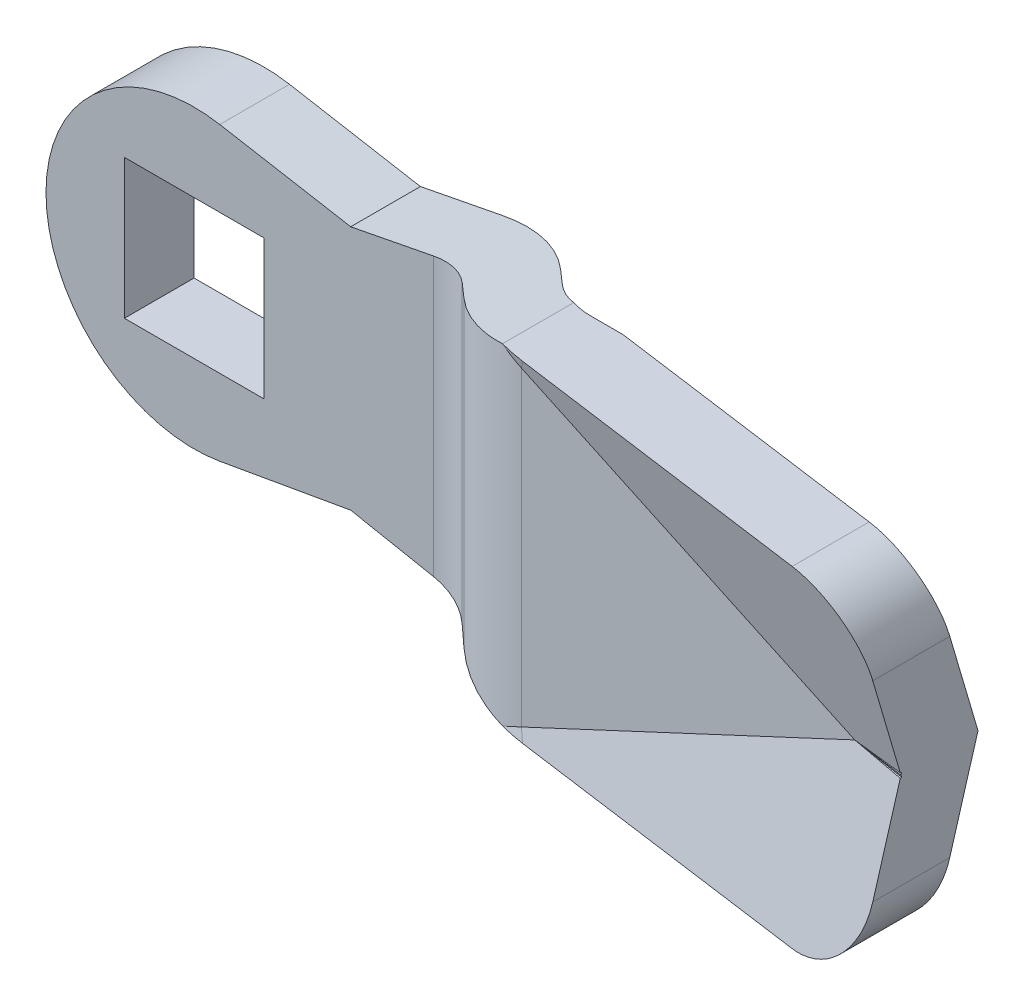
ISO-10303-21;
HEADER;
FILE_DESCRIPTION(('STEP AP214'),'2;1');
FILE_NAME('part.step','',(''),(''),'','','');
FILE_SCHEMA(('AUTOMOTIVE_DESIGN { 1 0 10303 214 1 1 1 1 }'));
ENDSEC;
DATA;
#1=APPLICATION_CONTEXT('core data for automotive mechanical design processes');
#2=APPLICATION_PROTOCOL_DEFINITION('international standard','automotive_design',2000,#1);
#3=PRODUCT_CONTEXT('',#1,'mechanical');
#4=PRODUCT('Part','Part','',(#3));
#5=PRODUCT_RELATED_PRODUCT_CATEGORY('part','',(#4));
#6=PRODUCT_DEFINITION_FORMATION('','',#4);
#7=PRODUCT_DEFINITION_CONTEXT('part definition',#1,'design');
#8=PRODUCT_DEFINITION('design','',#6,#7);
#9=PRODUCT_DEFINITION_SHAPE('','',#8);
#10=(LENGTH_UNIT() NAMED_UNIT(*) SI_UNIT(.MILLI.,.METRE.));
#11=(NAMED_UNIT(*) PLANE_ANGLE_UNIT() SI_UNIT($,.RADIAN.));
#12=(NAMED_UNIT(*) SI_UNIT($,.STERADIAN.) SOLID_ANGLE_UNIT());
#13=UNCERTAINTY_MEASURE_WITH_UNIT(LENGTH_MEASURE(1.E-05),#10,'distance_accuracy_value','');
#14=(GEOMETRIC_REPRESENTATION_CONTEXT(3) GLOBAL_UNCERTAINTY_ASSIGNED_CONTEXT((#13)) GLOBAL_UNIT_ASSIGNED_CONTEXT((#10,
#11,#12)) REPRESENTATION_CONTEXT('',''));
#15=CARTESIAN_POINT('',(0.,0.,0.));
#16=DIRECTION('',(0.,0.,1.));
#17=DIRECTION('',(1.,0.,0.));
#18=AXIS2_PLACEMENT_3D('',#15,#16,#17);
#19=CARTESIAN_POINT('',(68.0503983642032,-56.0267452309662,28.0861046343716));
#20=DIRECTION('',(0.130596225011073,-0.280064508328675,-0.951056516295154));
#21=DIRECTION('',(0.,-0.959272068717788,0.282483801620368));
#22=AXIS2_PLACEMENT_3D('',#19,#20,#21);
#23=PLANE('',#22);
#24=DIRECTION('',(-0.990703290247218,0.,-0.136040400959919));
#25=VECTOR('',#24,1.);
#26=CARTESIAN_POINT('',(69.8969690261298,-9.5,14.6386021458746));
#27=LINE('',#26,#25);
#28=CARTESIAN_POINT('',(41.,-9.5,10.6705571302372));
#29=VERTEX_POINT('',#28);
#30=CARTESIAN_POINT('',(23.0603304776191,-9.5,8.20713558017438));
#31=VERTEX_POINT('',#30);
#32=EDGE_CURVE('E494',#29,#31,#27,.T.);
#33=ORIENTED_EDGE('',*,*,#32,.F.);
#34=CARTESIAN_POINT('',(41.,-5.5,9.49264812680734));
#35=DIRECTION('',(0.130596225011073,-0.280064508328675,-0.951056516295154));
#36=DIRECTION('',(0.401933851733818,-0.861949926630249,0.309016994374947));
#37=AXIS2_PLACEMENT_3D('',#34,#35,#36);
#38=ELLIPSE('',#37,4.20584889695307,4.);
#39=CARTESIAN_POINT('',(45.,-5.5,10.0419161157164));
#40=VERTEX_POINT('',#39);
#41=EDGE_CURVE('E516',#29,#40,#38,.F.);
#42=ORIENTED_EDGE('',*,*,#41,.T.);
#43=DIRECTION('',(0.,0.959272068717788,-0.282483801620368));
#44=VECTOR('',#43,1.);
#45=CARTESIAN_POINT('',(45.,-56.884450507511,25.1734678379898));
#46=LINE('',#45,#44);
#47=CARTESIAN_POINT('',(45.,-0.136162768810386,8.46238807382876));
#48=VERTEX_POINT('',#47);
#49=EDGE_CURVE('E391',#40,#48,#46,.T.);
#50=ORIENTED_EDGE('',*,*,#49,.T.);
#51=DIRECTION('',(0.987938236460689,-0.0437421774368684,0.148541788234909));
#52=VECTOR('',#51,1.);
#53=CARTESIAN_POINT('',(72.7927650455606,-1.36672153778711,12.6411786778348));
#54=LINE('',#53,#52);
#55=CARTESIAN_POINT('',(41.9246980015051,0.,8.));
#56=VERTEX_POINT('',#55);
#57=EDGE_CURVE('E231',#56,#48,#54,.T.);
#58=ORIENTED_EDGE('',*,*,#57,.F.);
#59=DIRECTION('',(0.906307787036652,0.422618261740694,0.));
#60=VECTOR('',#59,1.);
#61=CARTESIAN_POINT('',(54.0925461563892,5.67396077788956,8.));
#62=LINE('',#61,#60);
#63=CARTESIAN_POINT('',(22.7909122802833,-8.92223081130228,8.));
#64=VERTEX_POINT('',#63);
#65=EDGE_CURVE('E451',#56,#64,#62,.F.);
#66=ORIENTED_EDGE('',*,*,#65,.T.);
#67=DIRECTION('',(-0.401933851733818,0.861949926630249,-0.309016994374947));
#68=VECTOR('',#67,1.);
#69=CARTESIAN_POINT('',(48.9166126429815,-64.9489760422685,28.0861046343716));
#70=LINE('',#69,#68);
#71=EDGE_CURVE('E438',#31,#64,#70,.T.);
#72=ORIENTED_EDGE('',*,*,#71,.F.);
#73=EDGE_LOOP('',(#33,#42,#50,#58,#66,#72));
#74=FACE_BOUND('',#73,.T.);
#75=ADVANCED_FACE('F14',(#74),#23,.F.);
#76=CARTESIAN_POINT('',(45.,32.7372831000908,-36.));
#77=DIRECTION('',(-1.,0.,0.));
#78=DIRECTION('',(0.,0.,-1.));
#79=AXIS2_PLACEMENT_3D('',#76,#77,#78);
#80=PLANE('',#79);
#81=ORIENTED_EDGE('',*,*,#49,.F.);
#82=DIRECTION('',(0.,0.,-1.));
#83=VECTOR('',#82,1.);
#84=CARTESIAN_POINT('',(45.,-5.5,-36.));
#85=LINE('',#84,#83);
#86=CARTESIAN_POINT('',(45.,-5.5,5.61962487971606));
#87=VERTEX_POINT('',#86);
#88=EDGE_CURVE('E509',#40,#87,#85,.T.);
#89=ORIENTED_EDGE('',*,*,#88,.T.);
#90=DIRECTION('',(0.,-0.959272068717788,0.282483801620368));
#91=VECTOR('',#90,1.);
#92=CARTESIAN_POINT('',(45.,-65.7408100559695,23.3591730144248));
#93=LINE('',#92,#91);
#94=CARTESIAN_POINT('',(45.,0.,4.));
#95=VERTEX_POINT('',#94);
#96=EDGE_CURVE('E395',#95,#87,#93,.T.);
#97=ORIENTED_EDGE('',*,*,#96,.F.);
#98=DIRECTION('',(0.,-0.959272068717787,-0.28248380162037));
#99=VECTOR('',#98,1.);
#100=CARTESIAN_POINT('',(45.,35.0762353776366,14.3291533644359));
#101=LINE('',#100,#99);
#102=CARTESIAN_POINT('',(45.,5.5,5.61962487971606));
#103=VERTEX_POINT('',#102);
#104=EDGE_CURVE('E393',#103,#95,#101,.T.);
#105=ORIENTED_EDGE('',*,*,#104,.F.);
#106=DIRECTION('',(0.,0.,-1.));
#107=VECTOR('',#106,1.);
#108=CARTESIAN_POINT('',(45.,5.5,-36.));
#109=LINE('',#108,#107);
#110=CARTESIAN_POINT('',(45.,5.5,10.0419161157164));
#111=VERTEX_POINT('',#110);
#112=EDGE_CURVE('E507',#103,#111,#109,.F.);
#113=ORIENTED_EDGE('',*,*,#112,.T.);
#114=DIRECTION('',(0.,0.959272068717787,0.28248380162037));
#115=VECTOR('',#114,1.);
#116=CARTESIAN_POINT('',(45.,43.172066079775,21.1354825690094));
#117=LINE('',#116,#115);
#118=CARTESIAN_POINT('',(45.,0.136162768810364,8.46238807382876));
#119=VERTEX_POINT('',#118);
#120=EDGE_CURVE('E389',#119,#111,#117,.T.);
#121=ORIENTED_EDGE('',*,*,#120,.F.);
#122=DIRECTION('',(0.,-0.282483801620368,-0.959272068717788));
#123=VECTOR('',#122,1.);
#124=CARTESIAN_POINT('',(45.,-9.31072791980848,-23.6178173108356));
#125=LINE('',#124,#123);
#126=CARTESIAN_POINT('',(45.,0.114431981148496,8.38859362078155));
#127=VERTEX_POINT('',#126);
#128=EDGE_CURVE('E503',#119,#127,#125,.T.);
#129=ORIENTED_EDGE('',*,*,#128,.T.);
#130=CARTESIAN_POINT('',(45.,0.,8.42229123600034));
#131=VERTEX_POINT('',#130);
#132=EDGE_CURVE('E246',#131,#127,#46,.T.);
#133=ORIENTED_EDGE('',*,*,#132,.F.);
#134=DIRECTION('',(0.,-0.959272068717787,-0.282483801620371));
#135=VECTOR('',#134,1.);
#136=CARTESIAN_POINT('',(45.,18.0874428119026,13.7486316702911));
#137=LINE('',#136,#135);
#138=CARTESIAN_POINT('',(45.,-0.114431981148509,8.38859362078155));
#139=VERTEX_POINT('',#138);
#140=EDGE_CURVE('E239',#131,#139,#137,.T.);
#141=ORIENTED_EDGE('',*,*,#140,.T.);
#142=DIRECTION('',(0.,0.28248380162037,-0.959272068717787));
#143=VECTOR('',#142,1.);
#144=CARTESIAN_POINT('',(45.,14.5354083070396,-41.3600380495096));
#145=LINE('',#144,#143);
#146=EDGE_CURVE('E225',#48,#139,#145,.T.);
#147=ORIENTED_EDGE('',*,*,#146,.F.);
#148=EDGE_LOOP('',(#81,#89,#97,#105,#113,#121,#129,#133,#141,#147));
#149=FACE_BOUND('',#148,.T.);
#150=ADVANCED_FACE('F244',(#149),#80,.F.);
#151=CARTESIAN_POINT('',(10.5,-2.8,-2.4));
#152=DIRECTION('',(1.,0.,0.));
#153=DIRECTION('',(0.,0.,1.));
#154=AXIS2_PLACEMENT_3D('',#151,#152,#153);
#155=PLANE('',#154);
#156=DIRECTION('',(0.,0.,1.));
#157=VECTOR('',#156,1.);
#158=CARTESIAN_POINT('',(10.5,-2.8,-2.4));
#159=LINE('',#158,#157);
#160=CARTESIAN_POINT('',(10.5,-2.8,-0.4));
#161=VERTEX_POINT('',#160);
#162=CARTESIAN_POINT('',(10.5,-2.8,0.));
#163=VERTEX_POINT('',#162);
#164=EDGE_CURVE('E291',#161,#163,#159,.T.);
#165=ORIENTED_EDGE('',*,*,#164,.F.);
#166=DIRECTION('',(0.,-1.,0.));
#167=VECTOR('',#166,1.);
#168=CARTESIAN_POINT('',(10.5,9.5,-0.4));
#169=LINE('',#168,#167);
#170=CARTESIAN_POINT('',(10.5,2.8,-0.4));
#171=VERTEX_POINT('',#170);
#172=EDGE_CURVE('E257',#171,#161,#169,.T.);
#173=ORIENTED_EDGE('',*,*,#172,.F.);
#174=DIRECTION('',(0.,0.,1.));
#175=VECTOR('',#174,1.);
#176=CARTESIAN_POINT('',(10.5,2.8,-2.4));
#177=LINE('',#176,#175);
#178=CARTESIAN_POINT('',(10.5,2.8,0.));
#179=VERTEX_POINT('',#178);
#180=EDGE_CURVE('E283',#171,#179,#177,.T.);
#181=ORIENTED_EDGE('',*,*,#180,.T.);
#182=DIRECTION('',(0.,1.,0.));
#183=VECTOR('',#182,1.);
#184=CARTESIAN_POINT('',(10.5,-2.8,0.));
#185=LINE('',#184,#183);
#186=EDGE_CURVE('E264',#163,#179,#185,.T.);
#187=ORIENTED_EDGE('',*,*,#186,.F.);
#188=EDGE_LOOP('',(#165,#173,#181,#187));
#189=FACE_BOUND('',#188,.T.);
#190=ADVANCED_FACE('F620',(#189),#155,.T.);
#191=CARTESIAN_POINT('',(10.5,-2.8,-2.4));
#192=DIRECTION('',(0.,1.,0.));
#193=DIRECTION('',(1.,0.,0.));
#194=AXIS2_PLACEMENT_3D('',#191,#192,#193);
#195=PLANE('',#194);
#196=DIRECTION('',(0.707106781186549,0.,0.707106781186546));
#197=VECTOR('',#196,1.);
#198=CARTESIAN_POINT('',(8.5,-2.8,-2.4));
#199=LINE('',#198,#197);
#200=CARTESIAN_POINT('',(8.5,-2.8,-2.4));
#201=VERTEX_POINT('',#200);
#202=EDGE_CURVE('E254',#201,#161,#199,.T.);
#203=ORIENTED_EDGE('',*,*,#202,.T.);
#204=ORIENTED_EDGE('',*,*,#164,.T.);
#205=DIRECTION('',(-1.,0.,0.));
#206=VECTOR('',#205,1.);
#207=CARTESIAN_POINT('',(10.5,-2.8,0.));
#208=LINE('',#207,#206);
#209=CARTESIAN_POINT('',(6.5,-2.8,0.));
#210=VERTEX_POINT('',#209);
#211=EDGE_CURVE('E272',#163,#210,#208,.T.);
#212=ORIENTED_EDGE('',*,*,#211,.T.);
#213=DIRECTION('',(0.,0.,1.));
#214=VECTOR('',#213,1.);
#215=CARTESIAN_POINT('',(6.5,-2.8,-2.4));
#216=LINE('',#215,#214);
#217=CARTESIAN_POINT('',(6.5,-2.8,-2.4));
#218=VERTEX_POINT('',#217);
#219=EDGE_CURVE('E288',#218,#210,#216,.T.);
#220=ORIENTED_EDGE('',*,*,#219,.F.);
#221=DIRECTION('',(-1.,0.,0.));
#222=VECTOR('',#221,1.);
#223=CARTESIAN_POINT('',(10.5,-2.8,-2.4));
#224=LINE('',#223,#222);
#225=EDGE_CURVE('E281',#201,#218,#224,.T.);
#226=ORIENTED_EDGE('',*,*,#225,.F.);
#227=EDGE_LOOP('',(#203,#204,#212,#220,#226));
#228=FACE_BOUND('',#227,.T.);
#229=ADVANCED_FACE('F653',(#228),#195,.F.);
#230=CARTESIAN_POINT('',(6.5,2.8,-2.4));
#231=DIRECTION('',(0.,-1.,0.));
#232=DIRECTION('',(-1.,0.,0.));
#233=AXIS2_PLACEMENT_3D('',#230,#231,#232);
#234=PLANE('',#233);
#235=DIRECTION('',(0.707106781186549,0.,0.707106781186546));
#236=VECTOR('',#235,1.);
#237=CARTESIAN_POINT('',(7.5,2.8,-3.4));
#238=LINE('',#237,#236);
#239=CARTESIAN_POINT('',(8.5,2.8,-2.4));
#240=VERTEX_POINT('',#239);
#241=EDGE_CURVE('E262',#240,#171,#238,.T.);
#242=ORIENTED_EDGE('',*,*,#241,.F.);
#243=DIRECTION('',(1.,0.,0.));
#244=VECTOR('',#243,1.);
#245=CARTESIAN_POINT('',(6.5,2.8,-2.4));
#246=LINE('',#245,#244);
#247=CARTESIAN_POINT('',(6.5,2.8,-2.4));
#248=VERTEX_POINT('',#247);
#249=EDGE_CURVE('E275',#248,#240,#246,.T.);
#250=ORIENTED_EDGE('',*,*,#249,.F.);
#251=DIRECTION('',(0.,0.,1.));
#252=VECTOR('',#251,1.);
#253=CARTESIAN_POINT('',(6.5,2.8,-2.4));
#254=LINE('',#253,#252);
#255=CARTESIAN_POINT('',(6.5,2.8,0.));
#256=VERTEX_POINT('',#255);
#257=EDGE_CURVE('E285',#248,#256,#254,.T.);
#258=ORIENTED_EDGE('',*,*,#257,.T.);
#259=DIRECTION('',(1.,0.,0.));
#260=VECTOR('',#259,1.);
#261=CARTESIAN_POINT('',(6.5,2.8,0.));
#262=LINE('',#261,#260);
#263=EDGE_CURVE('E267',#256,#179,#262,.T.);
#264=ORIENTED_EDGE('',*,*,#263,.T.);
#265=ORIENTED_EDGE('',*,*,#180,.F.);
#266=EDGE_LOOP('',(#242,#250,#258,#264,#265));
#267=FACE_BOUND('',#266,.T.);
#268=ADVANCED_FACE('F649',(#267),#234,.F.);
#269=CARTESIAN_POINT('',(10.5,2.8,-2.4));
#270=DIRECTION('',(0.,0.,-1.));
#271=DIRECTION('',(0.,-1.,0.));
#272=AXIS2_PLACEMENT_3D('',#269,#270,#271);
#273=PLANE('',#272);
#274=ORIENTED_EDGE('',*,*,#249,.T.);
#275=DIRECTION('',(0.,-1.,0.));
#276=VECTOR('',#275,1.);
#277=CARTESIAN_POINT('',(8.5,9.5,-2.4));
#278=LINE('',#277,#276);
#279=EDGE_CURVE('E259',#240,#201,#278,.T.);
#280=ORIENTED_EDGE('',*,*,#279,.T.);
#281=ORIENTED_EDGE('',*,*,#225,.T.);
#282=DIRECTION('',(0.,-1.,0.));
#283=VECTOR('',#282,1.);
#284=CARTESIAN_POINT('',(6.5,2.8,-2.4));
#285=LINE('',#284,#283);
#286=EDGE_CURVE('E278',#248,#218,#285,.T.);
#287=ORIENTED_EDGE('',*,*,#286,.F.);
#288=EDGE_LOOP('',(#274,#280,#281,#287));
#289=FACE_BOUND('',#288,.T.);
#290=ADVANCED_FACE('F646',(#289),#273,.T.);
#291=CARTESIAN_POINT('',(13.7420938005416,-9.5,0.));
#292=DIRECTION('',(0.,0.,-1.));
#293=DIRECTION('',(1.,0.,0.));
#294=AXIS2_PLACEMENT_3D('',#291,#292,#293);
#295=PLANE('',#294);
#296=DIRECTION('',(0.984807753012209,-0.173648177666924,0.));
#297=VECTOR('',#296,1.);
#298=CARTESIAN_POINT('',(16.4283241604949,5.73436940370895,0.));
#299=LINE('',#298,#297);
#300=CARTESIAN_POINT('',(1.47600951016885,8.37086590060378,0.));
#301=VERTEX_POINT('',#300);
#302=CARTESIAN_POINT('',(8.9917311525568,7.0456413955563,0.));
#303=VERTEX_POINT('',#302);
#304=EDGE_CURVE('E500',#301,#303,#299,.T.);
#305=ORIENTED_EDGE('',*,*,#304,.T.);
#306=DIRECTION('',(0.981627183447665,0.190808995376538,0.));
#307=VECTOR('',#306,1.);
#308=CARTESIAN_POINT('',(10.4700890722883,7.33300506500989,0.));
#309=LINE('',#308,#307);
#310=CARTESIAN_POINT('',(13.7420938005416,7.96901835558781,0.));
#311=VERTEX_POINT('',#310);
#312=EDGE_CURVE('E319',#303,#311,#309,.T.);
#313=ORIENTED_EDGE('',*,*,#312,.T.);
#314=DIRECTION('',(0.,1.,0.));
#315=VECTOR('',#314,1.);
#316=CARTESIAN_POINT('',(13.7420938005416,-9.5,0.));
#317=LINE('',#316,#315);
#318=CARTESIAN_POINT('',(13.7420938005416,-7.96901835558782,0.));
#319=VERTEX_POINT('',#318);
#320=EDGE_CURVE('E479',#319,#311,#317,.T.);
#321=ORIENTED_EDGE('',*,*,#320,.F.);
#322=DIRECTION('',(0.981627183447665,-0.190808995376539,0.));
#323=VECTOR('',#322,1.);
#324=CARTESIAN_POINT('',(14.0288517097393,-8.02475844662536,0.));
#325=LINE('',#324,#323);
#326=CARTESIAN_POINT('',(8.9917311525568,-7.0456413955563,0.));
#327=VERTEX_POINT('',#326);
#328=EDGE_CURVE('E334',#327,#319,#325,.T.);
#329=ORIENTED_EDGE('',*,*,#328,.F.);
#330=DIRECTION('',(0.984807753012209,0.173648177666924,0.));
#331=VECTOR('',#330,1.);
#332=CARTESIAN_POINT('',(13.1791327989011,-6.30728950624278,0.));
#333=LINE('',#332,#331);
#334=CARTESIAN_POINT('',(1.47600951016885,-8.37086590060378,0.));
#335=VERTEX_POINT('',#334);
#336=EDGE_CURVE('E498',#335,#327,#333,.T.);
#337=ORIENTED_EDGE('',*,*,#336,.F.);
#338=CARTESIAN_POINT('',(0.,0.,0.));
#339=DIRECTION('',(0.,0.,-1.));
#340=DIRECTION('',(1.,0.,0.));
#341=AXIS2_PLACEMENT_3D('',#338,#339,#340);
#342=CIRCLE('',#341,8.5);
#343=EDGE_CURVE('E348',#335,#301,#342,.T.);
#344=ORIENTED_EDGE('',*,*,#343,.T.);
#345=EDGE_LOOP('',(#305,#313,#321,#329,#337,#344));
#346=FACE_BOUND('',#345,.T.);
#347=DIRECTION('',(1.,0.,0.));
#348=VECTOR('',#347,1.);
#349=CARTESIAN_POINT('',(-4.,-4.,0.));
#350=LINE('',#349,#348);
#351=CARTESIAN_POINT('',(-4.,-4.,0.));
#352=VERTEX_POINT('',#351);
#353=CARTESIAN_POINT('',(4.,-4.,0.));
#354=VERTEX_POINT('',#353);
#355=EDGE_CURVE('E372',#352,#354,#350,.T.);
#356=ORIENTED_EDGE('',*,*,#355,.T.);
#357=DIRECTION('',(0.,-1.,0.));
#358=VECTOR('',#357,1.);
#359=CARTESIAN_POINT('',(4.,4.,0.));
#360=LINE('',#359,#358);
#361=CARTESIAN_POINT('',(4.,4.,0.));
#362=VERTEX_POINT('',#361);
#363=EDGE_CURVE('E369',#362,#354,#360,.T.);
#364=ORIENTED_EDGE('',*,*,#363,.F.);
#365=DIRECTION('',(-1.,0.,0.));
#366=VECTOR('',#365,1.);
#367=CARTESIAN_POINT('',(4.,4.,0.));
#368=LINE('',#367,#366);
#369=CARTESIAN_POINT('',(-4.,4.,0.));
#370=VERTEX_POINT('',#369);
#371=EDGE_CURVE('E377',#362,#370,#368,.T.);
#372=ORIENTED_EDGE('',*,*,#371,.T.);
#373=DIRECTION('',(0.,1.,0.));
#374=VECTOR('',#373,1.);
#375=CARTESIAN_POINT('',(-4.,-4.,0.));
#376=LINE('',#375,#374);
#377=EDGE_CURVE('E375',#352,#370,#376,.T.);
#378=ORIENTED_EDGE('',*,*,#377,.F.);
#379=EDGE_LOOP('',(#356,#364,#372,#378));
#380=FACE_BOUND('',#379,.T.);
#381=ORIENTED_EDGE('',*,*,#211,.F.);
#382=ORIENTED_EDGE('',*,*,#186,.T.);
#383=ORIENTED_EDGE('',*,*,#263,.F.);
#384=DIRECTION('',(0.,-1.,0.));
#385=VECTOR('',#384,1.);
#386=CARTESIAN_POINT('',(6.5,2.8,0.));
#387=LINE('',#386,#385);
#388=EDGE_CURVE('E270',#256,#210,#387,.T.);
#389=ORIENTED_EDGE('',*,*,#388,.T.);
#390=EDGE_LOOP('',(#381,#382,#383,#389));
#391=FACE_BOUND('',#390,.T.);
#392=ADVANCED_FACE('F593',(#346,#380,#391),#295,.T.);
#393=CARTESIAN_POINT('',(13.7420938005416,-9.5,4.));
#394=DIRECTION('',(0.,0.,-1.));
#395=DIRECTION('',(1.,0.,0.));
#396=AXIS2_PLACEMENT_3D('',#393,#394,#395);
#397=PLANE('',#396);
#398=DIRECTION('',(0.,-1.,0.));
#399=VECTOR('',#398,1.);
#400=CARTESIAN_POINT('',(4.,4.,4.));
#401=LINE('',#400,#399);
#402=CARTESIAN_POINT('',(4.,4.,4.));
#403=VERTEX_POINT('',#402);
#404=CARTESIAN_POINT('',(4.,-4.,4.));
#405=VERTEX_POINT('',#404);
#406=EDGE_CURVE('E357',#403,#405,#401,.T.);
#407=ORIENTED_EDGE('',*,*,#406,.T.);
#408=DIRECTION('',(1.,0.,0.));
#409=VECTOR('',#408,1.);
#410=CARTESIAN_POINT('',(-4.,-4.,4.));
#411=LINE('',#410,#409);
#412=CARTESIAN_POINT('',(-4.,-4.,4.));
#413=VERTEX_POINT('',#412);
#414=EDGE_CURVE('E360',#413,#405,#411,.T.);
#415=ORIENTED_EDGE('',*,*,#414,.F.);
#416=DIRECTION('',(0.,1.,0.));
#417=VECTOR('',#416,1.);
#418=CARTESIAN_POINT('',(-4.,-4.,4.));
#419=LINE('',#418,#417);
#420=CARTESIAN_POINT('',(-4.,4.,4.));
#421=VERTEX_POINT('',#420);
#422=EDGE_CURVE('E363',#413,#421,#419,.T.);
#423=ORIENTED_EDGE('',*,*,#422,.T.);
#424=DIRECTION('',(-1.,0.,0.));
#425=VECTOR('',#424,1.);
#426=CARTESIAN_POINT('',(4.,4.,4.));
#427=LINE('',#426,#425);
#428=EDGE_CURVE('E366',#403,#421,#427,.T.);
#429=ORIENTED_EDGE('',*,*,#428,.F.);
#430=EDGE_LOOP('',(#407,#415,#423,#429));
#431=FACE_BOUND('',#430,.T.);
#432=DIRECTION('',(0.981627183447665,0.190808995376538,0.));
#433=VECTOR('',#432,1.);
#434=CARTESIAN_POINT('',(10.4700890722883,7.33300506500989,4.));
#435=LINE('',#434,#433);
#436=CARTESIAN_POINT('',(8.9917311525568,7.0456413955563,4.));
#437=VERTEX_POINT('',#436);
#438=CARTESIAN_POINT('',(13.7420938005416,7.96901835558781,4.));
#439=VERTEX_POINT('',#438);
#440=EDGE_CURVE('E328',#437,#439,#435,.T.);
#441=ORIENTED_EDGE('',*,*,#440,.F.);
#442=DIRECTION('',(0.984807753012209,-0.173648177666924,0.));
#443=VECTOR('',#442,1.);
#444=CARTESIAN_POINT('',(16.4283241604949,5.73436940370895,4.));
#445=LINE('',#444,#443);
#446=CARTESIAN_POINT('',(1.47600951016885,8.37086590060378,4.));
#447=VERTEX_POINT('',#446);
#448=EDGE_CURVE('E355',#447,#437,#445,.T.);
#449=ORIENTED_EDGE('',*,*,#448,.F.);
#450=CARTESIAN_POINT('',(0.,0.,4.));
#451=DIRECTION('',(0.,0.,-1.));
#452=DIRECTION('',(1.,0.,0.));
#453=AXIS2_PLACEMENT_3D('',#450,#451,#452);
#454=CIRCLE('',#453,8.5);
#455=CARTESIAN_POINT('',(1.47600951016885,-8.37086590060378,4.));
#456=VERTEX_POINT('',#455);
#457=EDGE_CURVE('E350',#456,#447,#454,.T.);
#458=ORIENTED_EDGE('',*,*,#457,.F.);
#459=DIRECTION('',(0.984807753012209,0.173648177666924,0.));
#460=VECTOR('',#459,1.);
#461=CARTESIAN_POINT('',(13.1791327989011,-6.30728950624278,4.));
#462=LINE('',#461,#460);
#463=CARTESIAN_POINT('',(8.9917311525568,-7.0456413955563,4.));
#464=VERTEX_POINT('',#463);
#465=EDGE_CURVE('E352',#456,#464,#462,.T.);
#466=ORIENTED_EDGE('',*,*,#465,.T.);
#467=DIRECTION('',(0.981627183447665,-0.190808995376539,0.));
#468=VECTOR('',#467,1.);
#469=CARTESIAN_POINT('',(14.0288517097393,-8.02475844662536,4.));
#470=LINE('',#469,#468);
#471=CARTESIAN_POINT('',(13.7420938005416,-7.96901835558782,4.));
#472=VERTEX_POINT('',#471);
#473=EDGE_CURVE('E345',#464,#472,#470,.T.);
#474=ORIENTED_EDGE('',*,*,#473,.T.);
#475=DIRECTION('',(0.,1.,0.));
#476=VECTOR('',#475,1.);
#477=CARTESIAN_POINT('',(13.7420938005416,-9.5,4.));
#478=LINE('',#477,#476);
#479=EDGE_CURVE('E482',#472,#439,#478,.T.);
#480=ORIENTED_EDGE('',*,*,#479,.T.);
#481=EDGE_LOOP('',(#441,#449,#458,#466,#474,#480));
#482=FACE_BOUND('',#481,.T.);
#483=ADVANCED_FACE('F584',(#431,#482),#397,.F.);
#484=CARTESIAN_POINT('',(22.7909122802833,-9.5,0.));
#485=DIRECTION('',(0.,1.,0.));
#486=DIRECTION('',(1.,0.,0.));
#487=AXIS2_PLACEMENT_3D('',#484,#485,#486);
#488=CYLINDRICAL_SURFACE('',#487,8.);
#489=CARTESIAN_POINT('',(22.7909122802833,9.72793048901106,0.));
#490=DIRECTION('',(-0.190808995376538,0.981627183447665,0.));
#491=DIRECTION('',(0.981627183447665,0.190808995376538,0.));
#492=AXIS2_PLACEMENT_3D('',#489,#490,#491);
#493=ELLIPSE('',#492,8.1497335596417,8.);
#494=CARTESIAN_POINT('',(17.4378674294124,8.68740397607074,5.94515860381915));
#495=VERTEX_POINT('',#494);
#496=CARTESIAN_POINT('',(21.6183115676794,9.5,7.9135963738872));
#497=VERTEX_POINT('',#496);
#498=EDGE_CURVE('E326',#495,#497,#493,.T.);
#499=ORIENTED_EDGE('',*,*,#498,.F.);
#500=DIRECTION('',(0.,1.,0.));
#501=VECTOR('',#500,1.);
#502=CARTESIAN_POINT('',(17.4378674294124,-9.5,5.94515860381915));
#503=LINE('',#502,#501);
#504=CARTESIAN_POINT('',(17.4378674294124,-8.68740397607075,5.94515860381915));
#505=VERTEX_POINT('',#504);
#506=EDGE_CURVE('E488',#505,#495,#503,.T.);
#507=ORIENTED_EDGE('',*,*,#506,.F.);
#508=CARTESIAN_POINT('',(22.7909122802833,-9.72793048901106,0.));
#509=DIRECTION('',(0.190808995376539,0.981627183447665,0.));
#510=DIRECTION('',(-0.981627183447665,0.190808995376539,0.));
#511=AXIS2_PLACEMENT_3D('',#508,#509,#510);
#512=ELLIPSE('',#511,8.1497335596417,8.);
#513=CARTESIAN_POINT('',(21.6183115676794,-9.5,7.91359637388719));
#514=VERTEX_POINT('',#513);
#515=EDGE_CURVE('E342',#505,#514,#512,.T.);
#516=ORIENTED_EDGE('',*,*,#515,.T.);
#517=CARTESIAN_POINT('',(22.7909122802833,-11.7903045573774,0.));
#518=DIRECTION('',(-0.401933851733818,0.861949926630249,-0.309016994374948));
#519=DIRECTION('',(0.683336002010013,0.506993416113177,0.52536614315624));
#520=AXIS2_PLACEMENT_3D('',#517,#518,#519);
#521=ELLIPSE('',#520,9.28128160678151,8.);
#522=EDGE_CURVE('E457',#64,#514,#521,.F.);
#523=ORIENTED_EDGE('',*,*,#522,.F.);
#524=DIRECTION('',(0.,1.,0.));
#525=VECTOR('',#524,1.);
#526=CARTESIAN_POINT('',(22.7909122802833,-9.5,8.));
#527=LINE('',#526,#525);
#528=CARTESIAN_POINT('',(22.7909122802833,8.9222308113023,8.));
#529=VERTEX_POINT('',#528);
#530=EDGE_CURVE('E491',#64,#529,#527,.T.);
#531=ORIENTED_EDGE('',*,*,#530,.T.);
#532=CARTESIAN_POINT('',(22.7909122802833,11.7903045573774,0.));
#533=DIRECTION('',(-0.401933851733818,-0.861949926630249,-0.309016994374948));
#534=DIRECTION('',(-0.683336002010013,0.506993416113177,-0.52536614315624));
#535=AXIS2_PLACEMENT_3D('',#532,#533,#534);
#536=ELLIPSE('',#535,9.28128160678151,8.);
#537=EDGE_CURVE('E454',#529,#497,#536,.T.);
#538=ORIENTED_EDGE('',*,*,#537,.T.);
#539=EDGE_LOOP('',(#499,#507,#516,#523,#531,#538));
#540=FACE_BOUND('',#539,.T.);
#541=ADVANCED_FACE('F541',(#540),#488,.T.);
#542=CARTESIAN_POINT('',(22.7909122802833,-9.5,0.));
#543=DIRECTION('',(0.,-1.,0.));
#544=DIRECTION('',(-1.,0.,0.));
#545=AXIS2_PLACEMENT_3D('',#542,#543,#544);
#546=PLANE('',#545);
#547=DIRECTION('',(0.990703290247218,0.,0.136040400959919));
#548=VECTOR('',#547,1.);
#549=CARTESIAN_POINT('',(52.9764947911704,-9.5,7.89284219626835));
#550=LINE('',#549,#548);
#551=CARTESIAN_POINT('',(24.6271842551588,-9.5,4.));
#552=VERTEX_POINT('',#551);
#553=CARTESIAN_POINT('',(41.,-9.5,6.24826589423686));
#554=VERTEX_POINT('',#553);
#555=EDGE_CURVE('E398',#552,#554,#550,.T.);
#556=ORIENTED_EDGE('',*,*,#555,.T.);
#557=DIRECTION('',(0.,0.,-1.));
#558=VECTOR('',#557,1.);
#559=CARTESIAN_POINT('',(41.,-9.5,-36.));
#560=LINE('',#559,#558);
#561=EDGE_CURVE('E514',#554,#29,#560,.F.);
#562=ORIENTED_EDGE('',*,*,#561,.T.);
#563=ORIENTED_EDGE('',*,*,#32,.T.);
#564=CARTESIAN_POINT('',(21.6183115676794,-9.5,7.9135963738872));
#565=CARTESIAN_POINT('',(21.6973659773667,-9.50000000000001,7.93487714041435));
#566=CARTESIAN_POINT('',(21.776634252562,-9.50000000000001,7.95536573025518));
#567=CARTESIAN_POINT('',(21.9355021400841,-9.50000000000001,7.99470672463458));
#568=CARTESIAN_POINT('',(22.0151014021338,-9.50000000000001,8.01356054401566));
#569=CARTESIAN_POINT('',(22.1746370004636,-9.50000000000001,8.04960931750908));
#570=CARTESIAN_POINT('',(22.2545731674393,-9.50000000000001,8.06680502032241));
#571=CARTESIAN_POINT('',(22.4147913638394,-9.50000000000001,8.09951145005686));
#572=CARTESIAN_POINT('',(22.4950734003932,-9.50000000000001,8.11502214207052));
#573=CARTESIAN_POINT('',(22.6559863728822,-9.50000000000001,8.14432725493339));
#574=CARTESIAN_POINT('',(22.7366174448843,-9.50000000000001,8.15812092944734));
#575=CARTESIAN_POINT('',(22.8982340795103,-9.50000000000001,8.18395686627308));
#576=CARTESIAN_POINT('',(22.9792198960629,-9.50000000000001,8.19599753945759));
#577=CARTESIAN_POINT('',(23.0603304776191,-9.5,8.20713558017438));
#578=B_SPLINE_CURVE_WITH_KNOTS('',3,(#564,#565,#566,#567,#568,#569,#570,#571,#572,#573,#574,
#575,#576,#577),.UNSPECIFIED.,.F.,.F.,(4,2,2,2,2,2,4),(0.,0.245602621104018,0.490990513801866,
0.736267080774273,0.981548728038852,1.2269366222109,1.47254559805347),.UNSPECIFIED.);
#579=EDGE_CURVE('E401',#514,#31,#578,.T.);
#580=ORIENTED_EDGE('',*,*,#579,.F.);
#581=DIRECTION('',(0.,0.,1.));
#582=VECTOR('',#581,1.);
#583=CARTESIAN_POINT('',(21.6183115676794,-9.5,-21.));
#584=LINE('',#583,#582);
#585=CARTESIAN_POINT('',(21.6183115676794,-9.5,3.82426562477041));
#586=VERTEX_POINT('',#585);
#587=EDGE_CURVE('E293',#586,#514,#584,.T.);
#588=ORIENTED_EDGE('',*,*,#587,.F.);
#589=CARTESIAN_POINT('',(22.7909122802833,-9.5,0.));
#590=DIRECTION('',(0.,-1.,0.));
#591=DIRECTION('',(-1.,0.,0.));
#592=AXIS2_PLACEMENT_3D('',#589,#590,#591);
#593=CIRCLE('',#592,4.);
#594=CARTESIAN_POINT('',(22.7909122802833,-9.5,4.));
#595=VERTEX_POINT('',#594);
#596=EDGE_CURVE('E465',#595,#586,#593,.T.);
#597=ORIENTED_EDGE('',*,*,#596,.F.);
#598=DIRECTION('',(-1.,0.,0.));
#599=VECTOR('',#598,1.);
#600=CARTESIAN_POINT('',(45.,-9.5,4.));
#601=LINE('',#600,#599);
#602=EDGE_CURVE('E468',#552,#595,#601,.T.);
#603=ORIENTED_EDGE('',*,*,#602,.F.);
#604=EDGE_LOOP('',(#556,#562,#563,#580,#588,#597,#603));
#605=FACE_BOUND('',#604,.T.);
#606=ADVANCED_FACE('F558',(#605),#546,.T.);
#607=CARTESIAN_POINT('',(17.4378674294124,-9.5,5.94515860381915));
#608=DIRECTION('',(0.66913060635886,0.,-0.743144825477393));
#609=DIRECTION('',(0.743144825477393,0.,0.66913060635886));
#610=AXIS2_PLACEMENT_3D('',#607,#608,#609);
#611=PLANE('',#610);
#612=DIRECTION('',(0.735510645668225,0.142968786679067,0.662256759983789));
#613=VECTOR('',#612,1.);
#614=CARTESIAN_POINT('',(15.5253697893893,8.31565209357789,4.22313799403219));
#615=LINE('',#614,#613);
#616=CARTESIAN_POINT('',(16.418616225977,8.48928161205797,5.02742069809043));
#617=VERTEX_POINT('',#616);
#618=EDGE_CURVE('E324',#617,#495,#615,.T.);
#619=ORIENTED_EDGE('',*,*,#618,.F.);
#620=DIRECTION('',(0.,1.,0.));
#621=VECTOR('',#620,1.);
#622=CARTESIAN_POINT('',(16.418616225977,-9.5,5.02742069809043));
#623=LINE('',#622,#621);
#624=CARTESIAN_POINT('',(16.418616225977,-8.48928161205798,5.02742069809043));
#625=VERTEX_POINT('',#624);
#626=EDGE_CURVE('E485',#625,#617,#623,.T.);
#627=ORIENTED_EDGE('',*,*,#626,.F.);
#628=DIRECTION('',(0.735510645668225,-0.142968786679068,0.662256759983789));
#629=VECTOR('',#628,1.);
#630=CARTESIAN_POINT('',(17.5233160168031,-8.70401349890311,6.02209685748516));
#631=LINE('',#630,#629);
#632=EDGE_CURVE('E339',#625,#505,#631,.T.);
#633=ORIENTED_EDGE('',*,*,#632,.T.);
#634=ORIENTED_EDGE('',*,*,#506,.T.);
#635=EDGE_LOOP('',(#619,#627,#633,#634));
#636=FACE_BOUND('',#635,.T.);
#637=ADVANCED_FACE('F573',(#636),#611,.F.);
#638=CARTESIAN_POINT('',(13.7420938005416,-9.5,8.));
#639=DIRECTION('',(0.,1.,0.));
#640=DIRECTION('',(1.,0.,0.));
#641=AXIS2_PLACEMENT_3D('',#638,#639,#640);
#642=CYLINDRICAL_SURFACE('',#641,4.);
#643=CARTESIAN_POINT('',(13.7420938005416,7.96901835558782,8.));
#644=DIRECTION('',(-0.190808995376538,0.981627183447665,0.));
#645=DIRECTION('',(0.981627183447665,0.190808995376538,0.));
#646=AXIS2_PLACEMENT_3D('',#643,#644,#645);
#647=ELLIPSE('',#646,4.07486677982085,4.);
#648=EDGE_CURVE('E322',#439,#617,#647,.F.);
#649=ORIENTED_EDGE('',*,*,#648,.F.);
#650=ORIENTED_EDGE('',*,*,#479,.F.);
#651=CARTESIAN_POINT('',(13.7420938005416,-7.96901835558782,8.));
#652=DIRECTION('',(0.190808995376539,0.981627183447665,0.));
#653=DIRECTION('',(-0.981627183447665,0.190808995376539,0.));
#654=AXIS2_PLACEMENT_3D('',#651,#652,#653);
#655=ELLIPSE('',#654,4.07486677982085,4.);
#656=EDGE_CURVE('E336',#472,#625,#655,.F.);
#657=ORIENTED_EDGE('',*,*,#656,.T.);
#658=ORIENTED_EDGE('',*,*,#626,.T.);
#659=EDGE_LOOP('',(#649,#650,#657,#658));
#660=FACE_BOUND('',#659,.T.);
#661=ADVANCED_FACE('F581',(#660),#642,.F.);
#662=CARTESIAN_POINT('',(13.7420938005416,-9.5,8.));
#663=DIRECTION('',(0.,1.,0.));
#664=DIRECTION('',(1.,0.,0.));
#665=AXIS2_PLACEMENT_3D('',#662,#663,#664);
#666=CYLINDRICAL_SURFACE('',#665,8.);
#667=ORIENTED_EDGE('',*,*,#320,.T.);
#668=CARTESIAN_POINT('',(13.7420938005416,7.96901835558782,8.));
#669=DIRECTION('',(-0.190808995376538,0.981627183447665,0.));
#670=DIRECTION('',(0.981627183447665,0.190808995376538,0.));
#671=AXIS2_PLACEMENT_3D('',#668,#669,#670);
#672=ELLIPSE('',#671,8.1497335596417,8.);
#673=CARTESIAN_POINT('',(19.0951386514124,9.00954486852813,2.05484139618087));
#674=VERTEX_POINT('',#673);
#675=EDGE_CURVE('E316',#311,#674,#672,.F.);
#676=ORIENTED_EDGE('',*,*,#675,.T.);
#677=DIRECTION('',(0.,1.,0.));
#678=VECTOR('',#677,1.);
#679=CARTESIAN_POINT('',(19.0951386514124,-9.5,2.05484139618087));
#680=LINE('',#679,#678);
#681=CARTESIAN_POINT('',(19.0951386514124,-9.00954486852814,2.05484139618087));
#682=VERTEX_POINT('',#681);
#683=EDGE_CURVE('E476',#682,#674,#680,.T.);
#684=ORIENTED_EDGE('',*,*,#683,.F.);
#685=CARTESIAN_POINT('',(13.7420938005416,-7.96901835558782,8.));
#686=DIRECTION('',(0.190808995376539,0.981627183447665,0.));
#687=DIRECTION('',(-0.981627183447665,0.190808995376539,0.));
#688=AXIS2_PLACEMENT_3D('',#685,#686,#687);
#689=ELLIPSE('',#688,8.1497335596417,8.);
#690=EDGE_CURVE('E332',#319,#682,#689,.F.);
#691=ORIENTED_EDGE('',*,*,#690,.F.);
#692=EDGE_LOOP('',(#667,#676,#684,#691));
#693=FACE_BOUND('',#692,.T.);
#694=ADVANCED_FACE('F601',(#693),#666,.T.);
#695=CARTESIAN_POINT('',(20.1143898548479,-9.5,2.97257930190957));
#696=DIRECTION('',(0.66913060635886,0.,-0.743144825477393));
#697=DIRECTION('',(0.743144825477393,0.,0.66913060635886));
#698=AXIS2_PLACEMENT_3D('',#695,#696,#697);
#699=PLANE('',#698);
#700=ORIENTED_EDGE('',*,*,#683,.T.);
#701=DIRECTION('',(0.735510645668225,0.142968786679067,0.662256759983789));
#702=VECTOR('',#701,1.);
#703=CARTESIAN_POINT('',(18.1471838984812,8.82528113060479,1.20129910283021));
#704=LINE('',#703,#702);
#705=CARTESIAN_POINT('',(20.1143898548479,9.2076672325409,2.97257930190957));
#706=VERTEX_POINT('',#705);
#707=EDGE_CURVE('E313',#674,#706,#704,.T.);
#708=ORIENTED_EDGE('',*,*,#707,.T.);
#709=DIRECTION('',(0.,1.,0.));
#710=VECTOR('',#709,1.);
#711=CARTESIAN_POINT('',(20.1143898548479,-9.5,2.97257930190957));
#712=LINE('',#711,#710);
#713=CARTESIAN_POINT('',(20.1143898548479,-9.20766723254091,2.97257930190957));
#714=VERTEX_POINT('',#713);
#715=EDGE_CURVE('E473',#714,#706,#712,.T.);
#716=ORIENTED_EDGE('',*,*,#715,.F.);
#717=DIRECTION('',(0.735510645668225,-0.142968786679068,0.662256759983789));
#718=VECTOR('',#717,1.);
#719=CARTESIAN_POINT('',(20.145130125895,-9.21364253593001,3.00025796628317));
#720=LINE('',#719,#718);
#721=EDGE_CURVE('E330',#682,#714,#720,.T.);
#722=ORIENTED_EDGE('',*,*,#721,.F.);
#723=EDGE_LOOP('',(#700,#708,#716,#722));
#724=FACE_BOUND('',#723,.T.);
#725=ADVANCED_FACE('F603',(#724),#699,.T.);
#726=CARTESIAN_POINT('',(22.7909122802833,-9.5,0.));
#727=DIRECTION('',(0.,1.,0.));
#728=DIRECTION('',(1.,0.,0.));
#729=AXIS2_PLACEMENT_3D('',#726,#727,#728);
#730=CYLINDRICAL_SURFACE('',#729,4.);
#731=ORIENTED_EDGE('',*,*,#715,.T.);
#732=CARTESIAN_POINT('',(22.7909122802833,9.72793048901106,0.));
#733=DIRECTION('',(-0.190808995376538,0.981627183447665,0.));
#734=DIRECTION('',(0.981627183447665,0.190808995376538,0.));
#735=AXIS2_PLACEMENT_3D('',#732,#733,#734);
#736=ELLIPSE('',#735,4.07486677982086,4.);
#737=CARTESIAN_POINT('',(21.6183115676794,9.5,3.82426562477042));
#738=VERTEX_POINT('',#737);
#739=EDGE_CURVE('E310',#706,#738,#736,.T.);
#740=ORIENTED_EDGE('',*,*,#739,.T.);
#741=CARTESIAN_POINT('',(22.7909122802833,9.5,0.));
#742=DIRECTION('',(0.,-1.,0.));
#743=DIRECTION('',(-1.,0.,0.));
#744=AXIS2_PLACEMENT_3D('',#741,#742,#743);
#745=CIRCLE('',#744,4.);
#746=CARTESIAN_POINT('',(22.7909122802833,9.5,4.));
#747=VERTEX_POINT('',#746);
#748=EDGE_CURVE('E460',#747,#738,#745,.T.);
#749=ORIENTED_EDGE('',*,*,#748,.F.);
#750=DIRECTION('',(0.,1.,0.));
#751=VECTOR('',#750,1.);
#752=CARTESIAN_POINT('',(22.7909122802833,-9.5,4.));
#753=LINE('',#752,#751);
#754=EDGE_CURVE('E470',#595,#747,#753,.T.);
#755=ORIENTED_EDGE('',*,*,#754,.F.);
#756=ORIENTED_EDGE('',*,*,#596,.T.);
#757=CARTESIAN_POINT('',(22.7909122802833,-9.72793048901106,0.));
#758=DIRECTION('',(0.190808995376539,0.981627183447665,0.));
#759=DIRECTION('',(-0.981627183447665,0.190808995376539,0.));
#760=AXIS2_PLACEMENT_3D('',#757,#758,#759);
#761=ELLIPSE('',#760,4.07486677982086,4.);
#762=EDGE_CURVE('E496',#714,#586,#761,.T.);
#763=ORIENTED_EDGE('',*,*,#762,.F.);
#764=EDGE_LOOP('',(#731,#740,#749,#755,#756,#763));
#765=FACE_BOUND('',#764,.T.);
#766=ADVANCED_FACE('F567',(#765),#730,.F.);
#767=CARTESIAN_POINT('',(22.7909122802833,9.5,0.));
#768=DIRECTION('',(0.,-1.,0.));
#769=DIRECTION('',(-1.,0.,0.));
#770=AXIS2_PLACEMENT_3D('',#767,#768,#769);
#771=PLANE('',#770);
#772=DIRECTION('',(-0.990703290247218,0.,-0.13604040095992));
#773=VECTOR('',#772,1.);
#774=CARTESIAN_POINT('',(40.2137111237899,9.5,10.5625863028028));
#775=LINE('',#774,#773);
#776=CARTESIAN_POINT('',(41.,9.5,10.6705571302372));
#777=VERTEX_POINT('',#776);
#778=CARTESIAN_POINT('',(23.0603304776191,9.5,8.20713558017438));
#779=VERTEX_POINT('',#778);
#780=EDGE_CURVE('E435',#777,#779,#775,.T.);
#781=ORIENTED_EDGE('',*,*,#780,.F.);
#782=DIRECTION('',(0.,0.,-1.));
#783=VECTOR('',#782,1.);
#784=CARTESIAN_POINT('',(41.,9.5,0.));
#785=LINE('',#784,#783);
#786=CARTESIAN_POINT('',(41.,9.5,6.24826589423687));
#787=VERTEX_POINT('',#786);
#788=EDGE_CURVE('E518',#777,#787,#785,.T.);
#789=ORIENTED_EDGE('',*,*,#788,.T.);
#790=DIRECTION('',(0.990703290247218,0.,0.13604040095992));
#791=VECTOR('',#790,1.);
#792=CARTESIAN_POINT('',(62.0686900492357,9.5,9.14135514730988));
#793=LINE('',#792,#791);
#794=CARTESIAN_POINT('',(24.6271842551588,9.5,4.));
#795=VERTEX_POINT('',#794);
#796=EDGE_CURVE('E410',#795,#787,#793,.T.);
#797=ORIENTED_EDGE('',*,*,#796,.F.);
#798=DIRECTION('',(-1.,0.,0.));
#799=VECTOR('',#798,1.);
#800=CARTESIAN_POINT('',(45.,9.5,4.));
#801=LINE('',#800,#799);
#802=EDGE_CURVE('E463',#795,#747,#801,.T.);
#803=ORIENTED_EDGE('',*,*,#802,.T.);
#804=ORIENTED_EDGE('',*,*,#748,.T.);
#805=DIRECTION('',(0.,0.,1.));
#806=VECTOR('',#805,1.);
#807=CARTESIAN_POINT('',(21.6183115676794,9.5,-21.));
#808=LINE('',#807,#806);
#809=EDGE_CURVE('E307',#738,#497,#808,.T.);
#810=ORIENTED_EDGE('',*,*,#809,.T.);
#811=CARTESIAN_POINT('',(23.0603304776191,9.5,8.20713558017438));
#812=CARTESIAN_POINT('',(22.9792198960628,9.5,8.19599753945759));
#813=CARTESIAN_POINT('',(22.8982340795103,9.5,8.18395686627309));
#814=CARTESIAN_POINT('',(22.7366174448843,9.5,8.15812092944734));
#815=CARTESIAN_POINT('',(22.6559863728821,9.5,8.14432725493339));
#816=CARTESIAN_POINT('',(22.4950734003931,9.5,8.11502214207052));
#817=CARTESIAN_POINT('',(22.4147913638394,9.5,8.09951145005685));
#818=CARTESIAN_POINT('',(22.2545731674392,9.5,8.06680502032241));
#819=CARTESIAN_POINT('',(22.1746370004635,9.5,8.04960931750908));
#820=CARTESIAN_POINT('',(22.0151014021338,9.5,8.01356054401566));
#821=CARTESIAN_POINT('',(21.9355021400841,9.5,7.99470672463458));
#822=CARTESIAN_POINT('',(21.776634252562,9.5,7.95536573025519));
#823=CARTESIAN_POINT('',(21.6973659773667,9.5,7.93487714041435));
#824=CARTESIAN_POINT('',(21.6183115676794,9.5,7.9135963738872));
#825=B_SPLINE_CURVE_WITH_KNOTS('',3,(#811,#812,#813,#814,#815,#816,#817,#818,#819,#820,#821,
#822,#823,#824),.UNSPECIFIED.,.F.,.F.,(4,2,2,2,2,2,4),(0.,0.245608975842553,0.490996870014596,
0.736278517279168,0.981555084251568,1.22694297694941,1.47254559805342),.UNSPECIFIED.);
#826=EDGE_CURVE('E428',#779,#497,#825,.T.);
#827=ORIENTED_EDGE('',*,*,#826,.F.);
#828=EDGE_LOOP('',(#781,#789,#797,#803,#804,#810,#827));
#829=FACE_BOUND('',#828,.T.);
#830=ADVANCED_FACE('F527',(#829),#771,.F.);
#831=CARTESIAN_POINT('',(48.9166126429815,-67.8170497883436,20.0861046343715));
#832=DIRECTION('',(-0.401933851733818,0.861949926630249,-0.309016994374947));
#833=DIRECTION('',(0.683336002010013,0.506993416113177,0.52536614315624));
#834=AXIS2_PLACEMENT_3D('',#831,#832,#833);
#835=ELLIPSE('',#834,9.28128160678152,8.);
#836=DIRECTION('',(-0.401933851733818,0.861949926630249,-0.309016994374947));
#837=VECTOR('',#836,1.);
#838=SURFACE_OF_LINEAR_EXTRUSION('',#835,#837);
#839=ORIENTED_EDGE('',*,*,#522,.T.);
#840=ORIENTED_EDGE('',*,*,#579,.T.);
#841=ORIENTED_EDGE('',*,*,#71,.T.);
#842=EDGE_LOOP('',(#839,#840,#841));
#843=FACE_BOUND('',#842,.T.);
#844=ADVANCED_FACE('F412',(#843),#838,.T.);
#845=CARTESIAN_POINT('',(50.752884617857,-65.5267452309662,24.0861046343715));
#846=DIRECTION('',(-0.130596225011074,0.280064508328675,0.951056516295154));
#847=DIRECTION('',(0.,0.959272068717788,-0.282483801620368));
#848=AXIS2_PLACEMENT_3D('',#845,#846,#847);
#849=PLANE('',#848);
#850=ORIENTED_EDGE('',*,*,#96,.T.);
#851=CARTESIAN_POINT('',(41.,-5.5,5.070356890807));
#852=DIRECTION('',(-0.130596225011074,0.280064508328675,0.951056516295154));
#853=DIRECTION('',(0.401933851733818,-0.861949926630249,0.309016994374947));
#854=AXIS2_PLACEMENT_3D('',#851,#852,#853);
#855=ELLIPSE('',#854,4.20584889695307,4.);
#856=EDGE_CURVE('E512',#87,#554,#855,.F.);
#857=ORIENTED_EDGE('',*,*,#856,.T.);
#858=ORIENTED_EDGE('',*,*,#555,.F.);
#859=DIRECTION('',(-0.906307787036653,-0.422618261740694,0.));
#860=VECTOR('',#859,1.);
#861=CARTESIAN_POINT('',(45.,0.,4.));
#862=LINE('',#861,#860);
#863=EDGE_CURVE('E445',#95,#552,#862,.T.);
#864=ORIENTED_EDGE('',*,*,#863,.F.);
#865=EDGE_LOOP('',(#850,#857,#858,#864));
#866=FACE_BOUND('',#865,.T.);
#867=ADVANCED_FACE('F554',(#866),#849,.F.);
#868=DIRECTION('',(0.991435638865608,0.036891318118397,0.125277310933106));
#869=VECTOR('',#868,1.);
#870=CARTESIAN_POINT('',(41.9246980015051,0.,8.));
#871=LINE('',#870,#869);
#872=EDGE_CURVE('E251',#56,#127,#871,.T.);
#873=ORIENTED_EDGE('',*,*,#872,.F.);
#874=DIRECTION('',(0.990703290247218,0.,0.13604040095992));
#875=VECTOR('',#874,1.);
#876=CARTESIAN_POINT('',(70.2740085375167,0.,11.8928421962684));
#877=LINE('',#876,#875);
#878=EDGE_CURVE('E235',#56,#131,#877,.T.);
#879=ORIENTED_EDGE('',*,*,#878,.T.);
#880=ORIENTED_EDGE('',*,*,#132,.T.);
#881=EDGE_LOOP('',(#873,#879,#880));
#882=FACE_BOUND('',#881,.T.);
#883=ADVANCED_FACE('F612',(#882),#23,.F.);
#884=CARTESIAN_POINT('',(45.,-9.5,4.));
#885=DIRECTION('',(0.,0.,-1.));
#886=DIRECTION('',(0.,-1.,0.));
#887=AXIS2_PLACEMENT_3D('',#884,#885,#886);
#888=PLANE('',#887);
#889=DIRECTION('',(-0.906307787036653,0.422618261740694,0.));
#890=VECTOR('',#889,1.);
#891=CARTESIAN_POINT('',(45.,0.,4.));
#892=LINE('',#891,#890);
#893=EDGE_CURVE('E442',#95,#795,#892,.T.);
#894=ORIENTED_EDGE('',*,*,#893,.F.);
#895=ORIENTED_EDGE('',*,*,#863,.T.);
#896=ORIENTED_EDGE('',*,*,#602,.T.);
#897=ORIENTED_EDGE('',*,*,#754,.T.);
#898=ORIENTED_EDGE('',*,*,#802,.F.);
#899=EDGE_LOOP('',(#894,#895,#896,#897,#898));
#900=FACE_BOUND('',#899,.T.);
#901=ADVANCED_FACE('F563',(#900),#888,.T.);
#902=CARTESIAN_POINT('',(45.,-9.5,8.));
#903=DIRECTION('',(0.,0.,-1.));
#904=DIRECTION('',(0.,-1.,0.));
#905=AXIS2_PLACEMENT_3D('',#902,#903,#904);
#906=PLANE('',#905);
#907=ORIENTED_EDGE('',*,*,#65,.F.);
#908=DIRECTION('',(-0.906307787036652,0.422618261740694,0.));
#909=VECTOR('',#908,1.);
#910=CARTESIAN_POINT('',(59.4507320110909,-8.17252387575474,8.));
#911=LINE('',#910,#909);
#912=EDGE_CURVE('E448',#56,#529,#911,.T.);
#913=ORIENTED_EDGE('',*,*,#912,.T.);
#914=ORIENTED_EDGE('',*,*,#530,.F.);
#915=EDGE_LOOP('',(#907,#913,#914));
#916=FACE_BOUND('',#915,.T.);
#917=ADVANCED_FACE('F16',(#916),#906,.F.);
#918=CARTESIAN_POINT('',(38.8682663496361,46.2683016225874,12.3606797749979));
#919=DIRECTION('',(0.401933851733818,0.861949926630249,0.309016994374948));
#920=DIRECTION('',(-0.683336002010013,0.506993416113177,-0.525366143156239));
#921=AXIS2_PLACEMENT_3D('',#918,#919,#920);
#922=ELLIPSE('',#921,9.28128160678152,8.);
#923=DIRECTION('',(-0.401933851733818,-0.861949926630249,-0.309016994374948));
#924=VECTOR('',#923,1.);
#925=SURFACE_OF_LINEAR_EXTRUSION('',#922,#924);
#926=DIRECTION('',(-0.401933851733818,-0.861949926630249,-0.309016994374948));
#927=VECTOR('',#926,1.);
#928=CARTESIAN_POINT('',(38.8682663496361,43.4002278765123,20.360679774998));
#929=LINE('',#928,#927);
#930=EDGE_CURVE('E434',#779,#529,#929,.T.);
#931=ORIENTED_EDGE('',*,*,#930,.F.);
#932=ORIENTED_EDGE('',*,*,#826,.T.);
#933=ORIENTED_EDGE('',*,*,#537,.F.);
#934=EDGE_LOOP('',(#931,#932,#933));
#935=FACE_BOUND('',#934,.T.);
#936=ADVANCED_FACE('F423',(#935),#925,.F.);
#937=CARTESIAN_POINT('',(38.8682663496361,43.4002278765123,20.360679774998));
#938=DIRECTION('',(0.130596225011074,0.280064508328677,-0.951056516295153));
#939=DIRECTION('',(0.,-0.959272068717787,-0.28248380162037));
#940=AXIS2_PLACEMENT_3D('',#937,#938,#939);
#941=PLANE('',#940);
#942=ORIENTED_EDGE('',*,*,#120,.T.);
#943=CARTESIAN_POINT('',(41.,5.5,9.49264812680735));
#944=DIRECTION('',(0.130596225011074,0.280064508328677,-0.951056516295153));
#945=DIRECTION('',(-0.401933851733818,-0.861949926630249,-0.309016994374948));
#946=AXIS2_PLACEMENT_3D('',#943,#944,#945);
#947=ELLIPSE('',#946,4.20584889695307,4.);
#948=EDGE_CURVE('E9',#111,#777,#947,.F.);
#949=ORIENTED_EDGE('',*,*,#948,.T.);
#950=ORIENTED_EDGE('',*,*,#780,.T.);
#951=ORIENTED_EDGE('',*,*,#930,.T.);
#952=ORIENTED_EDGE('',*,*,#912,.F.);
#953=DIRECTION('',(-0.987938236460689,-0.0437421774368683,-0.148541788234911));
#954=VECTOR('',#953,1.);
#955=CARTESIAN_POINT('',(41.9973152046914,0.00321521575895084,8.0109183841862));
#956=LINE('',#955,#954);
#957=EDGE_CURVE('E505',#119,#56,#956,.T.);
#958=ORIENTED_EDGE('',*,*,#957,.F.);
#959=EDGE_LOOP('',(#942,#949,#950,#951,#952,#958));
#960=FACE_BOUND('',#959,.T.);
#961=ADVANCED_FACE('F530',(#960),#941,.F.);
#962=CARTESIAN_POINT('',(61.0773540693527,34.47799706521,16.3606797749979));
#963=DIRECTION('',(-0.130596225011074,-0.280064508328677,0.951056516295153));
#964=DIRECTION('',(0.,0.959272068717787,0.28248380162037));
#965=AXIS2_PLACEMENT_3D('',#962,#963,#964);
#966=PLANE('',#965);
#967=ORIENTED_EDGE('',*,*,#796,.T.);
#968=CARTESIAN_POINT('',(41.,5.5,5.070356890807));
#969=DIRECTION('',(-0.130596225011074,-0.280064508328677,0.951056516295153));
#970=DIRECTION('',(-0.401933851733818,-0.861949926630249,-0.309016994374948));
#971=AXIS2_PLACEMENT_3D('',#968,#969,#970);
#972=ELLIPSE('',#971,4.20584889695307,4.);
#973=EDGE_CURVE('E22',#787,#103,#972,.F.);
#974=ORIENTED_EDGE('',*,*,#973,.T.);
#975=ORIENTED_EDGE('',*,*,#104,.T.);
#976=ORIENTED_EDGE('',*,*,#893,.T.);
#977=EDGE_LOOP('',(#967,#974,#975,#976));
#978=FACE_BOUND('',#977,.T.);
#979=ADVANCED_FACE('F522',(#978),#966,.F.);
#980=CARTESIAN_POINT('',(4.,4.,0.));
#981=DIRECTION('',(-1.,0.,0.));
#982=DIRECTION('',(0.,0.,-1.));
#983=AXIS2_PLACEMENT_3D('',#980,#981,#982);
#984=PLANE('',#983);
#985=DIRECTION('',(0.,0.,1.));
#986=VECTOR('',#985,1.);
#987=CARTESIAN_POINT('',(4.,-4.,0.));
#988=LINE('',#987,#986);
#989=EDGE_CURVE('E387',#354,#405,#988,.T.);
#990=ORIENTED_EDGE('',*,*,#989,.T.);
#991=ORIENTED_EDGE('',*,*,#406,.F.);
#992=DIRECTION('',(0.,0.,1.));
#993=VECTOR('',#992,1.);
#994=CARTESIAN_POINT('',(4.,4.,0.));
#995=LINE('',#994,#993);
#996=EDGE_CURVE('E380',#362,#403,#995,.T.);
#997=ORIENTED_EDGE('',*,*,#996,.F.);
#998=ORIENTED_EDGE('',*,*,#363,.T.);
#999=EDGE_LOOP('',(#990,#991,#997,#998));
#1000=FACE_BOUND('',#999,.T.);
#1001=ADVANCED_FACE('F679',(#1000),#984,.T.);
#1002=CARTESIAN_POINT('',(-4.,-4.,0.));
#1003=DIRECTION('',(0.,-1.,0.));
#1004=DIRECTION('',(-1.,0.,0.));
#1005=AXIS2_PLACEMENT_3D('',#1002,#1003,#1004);
#1006=PLANE('',#1005);
#1007=DIRECTION('',(0.,0.,1.));
#1008=VECTOR('',#1007,1.);
#1009=CARTESIAN_POINT('',(-4.,-4.,0.));
#1010=LINE('',#1009,#1008);
#1011=EDGE_CURVE('E385',#352,#413,#1010,.T.);
#1012=ORIENTED_EDGE('',*,*,#1011,.T.);
#1013=ORIENTED_EDGE('',*,*,#414,.T.);
#1014=ORIENTED_EDGE('',*,*,#989,.F.);
#1015=ORIENTED_EDGE('',*,*,#355,.F.);
#1016=EDGE_LOOP('',(#1012,#1013,#1014,#1015));
#1017=FACE_BOUND('',#1016,.T.);
#1018=ADVANCED_FACE('F682',(#1017),#1006,.F.);
#1019=CARTESIAN_POINT('',(-4.,-4.,0.));
#1020=DIRECTION('',(1.,0.,0.));
#1021=DIRECTION('',(0.,0.,1.));
#1022=AXIS2_PLACEMENT_3D('',#1019,#1020,#1021);
#1023=PLANE('',#1022);
#1024=DIRECTION('',(0.,0.,1.));
#1025=VECTOR('',#1024,1.);
#1026=CARTESIAN_POINT('',(-4.,4.,0.));
#1027=LINE('',#1026,#1025);
#1028=EDGE_CURVE('E383',#370,#421,#1027,.T.);
#1029=ORIENTED_EDGE('',*,*,#1028,.T.);
#1030=ORIENTED_EDGE('',*,*,#422,.F.);
#1031=ORIENTED_EDGE('',*,*,#1011,.F.);
#1032=ORIENTED_EDGE('',*,*,#377,.T.);
#1033=EDGE_LOOP('',(#1029,#1030,#1031,#1032));
#1034=FACE_BOUND('',#1033,.T.);
#1035=ADVANCED_FACE('F686',(#1034),#1023,.T.);
#1036=CARTESIAN_POINT('',(4.,4.,0.));
#1037=DIRECTION('',(0.,1.,0.));
#1038=DIRECTION('',(1.,0.,0.));
#1039=AXIS2_PLACEMENT_3D('',#1036,#1037,#1038);
#1040=PLANE('',#1039);
#1041=ORIENTED_EDGE('',*,*,#371,.F.);
#1042=ORIENTED_EDGE('',*,*,#996,.T.);
#1043=ORIENTED_EDGE('',*,*,#428,.T.);
#1044=ORIENTED_EDGE('',*,*,#1028,.F.);
#1045=EDGE_LOOP('',(#1041,#1042,#1043,#1044));
#1046=FACE_BOUND('',#1045,.T.);
#1047=ADVANCED_FACE('F675',(#1046),#1040,.F.);
#1048=CARTESIAN_POINT('',(8.9917311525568,7.0456413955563,-21.));
#1049=DIRECTION('',(0.173648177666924,0.984807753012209,0.));
#1050=DIRECTION('',(0.984807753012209,-0.173648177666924,0.));
#1051=AXIS2_PLACEMENT_3D('',#1048,#1049,#1050);
#1052=PLANE('',#1051);
#1053=ORIENTED_EDGE('',*,*,#448,.T.);
#1054=DIRECTION('',(0.,0.,1.));
#1055=VECTOR('',#1054,1.);
#1056=CARTESIAN_POINT('',(8.9917311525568,7.0456413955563,-21.));
#1057=LINE('',#1056,#1055);
#1058=EDGE_CURVE('E304',#303,#437,#1057,.T.);
#1059=ORIENTED_EDGE('',*,*,#1058,.F.);
#1060=ORIENTED_EDGE('',*,*,#304,.F.);
#1061=DIRECTION('',(0.,0.,1.));
#1062=VECTOR('',#1061,1.);
#1063=CARTESIAN_POINT('',(1.47600951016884,8.37086590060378,-21.));
#1064=LINE('',#1063,#1062);
#1065=EDGE_CURVE('E301',#301,#447,#1064,.T.);
#1066=ORIENTED_EDGE('',*,*,#1065,.T.);
#1067=EDGE_LOOP('',(#1053,#1059,#1060,#1066));
#1068=FACE_BOUND('',#1067,.T.);
#1069=ADVANCED_FACE('F669',(#1068),#1052,.T.);
#1070=CARTESIAN_POINT('',(8.9917311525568,-7.0456413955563,-21.));
#1071=DIRECTION('',(-0.173648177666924,0.984807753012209,0.));
#1072=DIRECTION('',(0.984807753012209,0.173648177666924,0.));
#1073=AXIS2_PLACEMENT_3D('',#1070,#1071,#1072);
#1074=PLANE('',#1073);
#1075=DIRECTION('',(0.,0.,1.));
#1076=VECTOR('',#1075,1.);
#1077=CARTESIAN_POINT('',(1.47600951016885,-8.37086590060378,-21.));
#1078=LINE('',#1077,#1076);
#1079=EDGE_CURVE('E298',#335,#456,#1078,.T.);
#1080=ORIENTED_EDGE('',*,*,#1079,.F.);
#1081=ORIENTED_EDGE('',*,*,#336,.T.);
#1082=DIRECTION('',(0.,0.,1.));
#1083=VECTOR('',#1082,1.);
#1084=CARTESIAN_POINT('',(8.9917311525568,-7.0456413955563,-21.));
#1085=LINE('',#1084,#1083);
#1086=EDGE_CURVE('E295',#327,#464,#1085,.T.);
#1087=ORIENTED_EDGE('',*,*,#1086,.T.);
#1088=ORIENTED_EDGE('',*,*,#465,.F.);
#1089=EDGE_LOOP('',(#1080,#1081,#1087,#1088));
#1090=FACE_BOUND('',#1089,.T.);
#1091=ADVANCED_FACE('F590',(#1090),#1074,.F.);
#1092=CARTESIAN_POINT('',(0.,0.,-21.));
#1093=DIRECTION('',(0.,0.,1.));
#1094=DIRECTION('',(-1.,0.,0.));
#1095=AXIS2_PLACEMENT_3D('',#1092,#1093,#1094);
#1096=CYLINDRICAL_SURFACE('',#1095,8.5);
#1097=ORIENTED_EDGE('',*,*,#457,.T.);
#1098=ORIENTED_EDGE('',*,*,#1065,.F.);
#1099=ORIENTED_EDGE('',*,*,#343,.F.);
#1100=ORIENTED_EDGE('',*,*,#1079,.T.);
#1101=EDGE_LOOP('',(#1097,#1098,#1099,#1100));
#1102=FACE_BOUND('',#1101,.T.);
#1103=ADVANCED_FACE('F666',(#1102),#1096,.T.);
#1104=CARTESIAN_POINT('',(21.6183115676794,-9.5,-21.));
#1105=DIRECTION('',(0.190808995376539,0.981627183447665,0.));
#1106=DIRECTION('',(0.981627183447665,-0.190808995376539,0.));
#1107=AXIS2_PLACEMENT_3D('',#1104,#1105,#1106);
#1108=PLANE('',#1107);
#1109=ORIENTED_EDGE('',*,*,#1086,.F.);
#1110=ORIENTED_EDGE('',*,*,#328,.T.);
#1111=ORIENTED_EDGE('',*,*,#690,.T.);
#1112=ORIENTED_EDGE('',*,*,#721,.T.);
#1113=ORIENTED_EDGE('',*,*,#762,.T.);
#1114=ORIENTED_EDGE('',*,*,#587,.T.);
#1115=ORIENTED_EDGE('',*,*,#515,.F.);
#1116=ORIENTED_EDGE('',*,*,#632,.F.);
#1117=ORIENTED_EDGE('',*,*,#656,.F.);
#1118=ORIENTED_EDGE('',*,*,#473,.F.);
#1119=EDGE_LOOP('',(#1109,#1110,#1111,#1112,#1113,#1114,#1115,#1116,#1117,#1118));
#1120=FACE_BOUND('',#1119,.T.);
#1121=ADVANCED_FACE('F577',(#1120),#1108,.F.);
#1122=CARTESIAN_POINT('',(21.6183115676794,9.5,-21.));
#1123=DIRECTION('',(-0.190808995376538,0.981627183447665,0.));
#1124=DIRECTION('',(0.981627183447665,0.190808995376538,0.));
#1125=AXIS2_PLACEMENT_3D('',#1122,#1123,#1124);
#1126=PLANE('',#1125);
#1127=ORIENTED_EDGE('',*,*,#440,.T.);
#1128=ORIENTED_EDGE('',*,*,#648,.T.);
#1129=ORIENTED_EDGE('',*,*,#618,.T.);
#1130=ORIENTED_EDGE('',*,*,#498,.T.);
#1131=ORIENTED_EDGE('',*,*,#809,.F.);
#1132=ORIENTED_EDGE('',*,*,#739,.F.);
#1133=ORIENTED_EDGE('',*,*,#707,.F.);
#1134=ORIENTED_EDGE('',*,*,#675,.F.);
#1135=ORIENTED_EDGE('',*,*,#312,.F.);
#1136=ORIENTED_EDGE('',*,*,#1058,.T.);
#1137=EDGE_LOOP('',(#1127,#1128,#1129,#1130,#1131,#1132,#1133,#1134,#1135,#1136));
#1138=FACE_BOUND('',#1137,.T.);
#1139=ADVANCED_FACE('F570',(#1138),#1126,.T.);
#1140=CARTESIAN_POINT('',(6.5,2.8,-2.4));
#1141=DIRECTION('',(-1.,0.,0.));
#1142=DIRECTION('',(0.,0.,-1.));
#1143=AXIS2_PLACEMENT_3D('',#1140,#1141,#1142);
#1144=PLANE('',#1143);
#1145=ORIENTED_EDGE('',*,*,#257,.F.);
#1146=ORIENTED_EDGE('',*,*,#286,.T.);
#1147=ORIENTED_EDGE('',*,*,#219,.T.);
#1148=ORIENTED_EDGE('',*,*,#388,.F.);
#1149=EDGE_LOOP('',(#1145,#1146,#1147,#1148));
#1150=FACE_BOUND('',#1149,.T.);
#1151=ADVANCED_FACE('F641',(#1150),#1144,.T.);
#1152=CARTESIAN_POINT('',(8.5,9.5,-2.4));
#1153=DIRECTION('',(0.707106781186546,0.,-0.707106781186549));
#1154=DIRECTION('',(0.707106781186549,0.,0.707106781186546));
#1155=AXIS2_PLACEMENT_3D('',#1152,#1153,#1154);
#1156=PLANE('',#1155);
#1157=ORIENTED_EDGE('',*,*,#241,.T.);
#1158=ORIENTED_EDGE('',*,*,#172,.T.);
#1159=ORIENTED_EDGE('',*,*,#202,.F.);
#1160=ORIENTED_EDGE('',*,*,#279,.F.);
#1161=EDGE_LOOP('',(#1157,#1158,#1159,#1160));
#1162=FACE_BOUND('',#1161,.T.);
#1163=ADVANCED_FACE('F633',(#1162),#1156,.T.);
#1164=CARTESIAN_POINT('',(41.5329093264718,0.840193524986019,10.8531695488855));
#1165=DIRECTION('',(0.,0.959272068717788,-0.282483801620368));
#1166=DIRECTION('',(0.,-0.282483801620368,-0.959272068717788));
#1167=AXIS2_PLACEMENT_3D('',#1164,#1165,#1166);
#1168=PLANE('',#1167);
#1169=ORIENTED_EDGE('',*,*,#128,.F.);
#1170=ORIENTED_EDGE('',*,*,#957,.T.);
#1171=ORIENTED_EDGE('',*,*,#872,.T.);
#1172=EDGE_LOOP('',(#1169,#1170,#1171));
#1173=FACE_BOUND('',#1172,.T.);
#1174=ADVANCED_FACE('F631',(#1173),#1168,.F.);
#1175=CARTESIAN_POINT('',(41.5329093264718,-0.840193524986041,10.8531695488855));
#1176=DIRECTION('',(0.,0.959272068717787,0.28248380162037));
#1177=DIRECTION('',(0.,0.28248380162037,-0.959272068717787));
#1178=AXIS2_PLACEMENT_3D('',#1175,#1176,#1177);
#1179=PLANE('',#1178);
#1180=ORIENTED_EDGE('',*,*,#57,.T.);
#1181=ORIENTED_EDGE('',*,*,#146,.T.);
#1182=DIRECTION('',(0.991435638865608,-0.0368913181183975,0.125277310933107));
#1183=VECTOR('',#1182,1.);
#1184=CARTESIAN_POINT('',(41.9246980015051,0.,8.));
#1185=LINE('',#1184,#1183);
#1186=EDGE_CURVE('E228',#56,#139,#1185,.T.);
#1187=ORIENTED_EDGE('',*,*,#1186,.F.);
#1188=EDGE_LOOP('',(#1180,#1181,#1187));
#1189=FACE_BOUND('',#1188,.T.);
#1190=ADVANCED_FACE('F227',(#1189),#1179,.T.);
#1191=CARTESIAN_POINT('',(22.7909122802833,8.92223081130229,8.));
#1192=DIRECTION('',(0.130596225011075,0.280064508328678,-0.951056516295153));
#1193=DIRECTION('',(0.,-0.959272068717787,-0.282483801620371));
#1194=AXIS2_PLACEMENT_3D('',#1191,#1192,#1193);
#1195=PLANE('',#1194);
#1196=ORIENTED_EDGE('',*,*,#1186,.T.);
#1197=ORIENTED_EDGE('',*,*,#140,.F.);
#1198=ORIENTED_EDGE('',*,*,#878,.F.);
#1199=EDGE_LOOP('',(#1196,#1197,#1198));
#1200=FACE_BOUND('',#1199,.T.);
#1201=ADVANCED_FACE('F238',(#1200),#1195,.F.);
#1202=CARTESIAN_POINT('',(41.,-5.5,-36.));
#1203=DIRECTION('',(0.,0.,1.));
#1204=DIRECTION('',(-1.,0.,0.));
#1205=AXIS2_PLACEMENT_3D('',#1202,#1203,#1204);
#1206=CYLINDRICAL_SURFACE('',#1205,4.);
#1207=ORIENTED_EDGE('',*,*,#41,.F.);
#1208=ORIENTED_EDGE('',*,*,#561,.F.);
#1209=ORIENTED_EDGE('',*,*,#856,.F.);
#1210=ORIENTED_EDGE('',*,*,#88,.F.);
#1211=EDGE_LOOP('',(#1207,#1208,#1209,#1210));
#1212=FACE_BOUND('',#1211,.T.);
#1213=ADVANCED_FACE('F551',(#1212),#1206,.T.);
#1214=CARTESIAN_POINT('',(41.,5.5,0.));
#1215=DIRECTION('',(0.,0.,-1.));
#1216=DIRECTION('',(1.,0.,0.));
#1217=AXIS2_PLACEMENT_3D('',#1214,#1215,#1216);
#1218=CYLINDRICAL_SURFACE('',#1217,4.);
#1219=ORIENTED_EDGE('',*,*,#948,.F.);
#1220=ORIENTED_EDGE('',*,*,#112,.F.);
#1221=ORIENTED_EDGE('',*,*,#973,.F.);
#1222=ORIENTED_EDGE('',*,*,#788,.F.);
#1223=EDGE_LOOP('',(#1219,#1220,#1221,#1222));
#1224=FACE_BOUND('',#1223,.T.);
#1225=ADVANCED_FACE('F525',(#1224),#1218,.T.);
#1226=CLOSED_SHELL('',(#75,#150,#190,#229,#268,#290,#392,#483,#541,#606,#637,#661,#694,#725,
#766,#830,#844,#867,#883,#901,#917,#936,#961,#979,#1001,#1018,#1035,#1047,#1069,#1091,#1103,
#1121,#1139,#1151,#1163,#1174,#1190,#1201,#1213,#1225));
#1227=MANIFOLD_SOLID_BREP('B1',#1226);
#1228=ADVANCED_BREP_SHAPE_REPRESENTATION('',(#18,#1227),#14);
#1229=SHAPE_DEFINITION_REPRESENTATION(#9,#1228);
ENDSEC;
END-ISO-10303-21;
